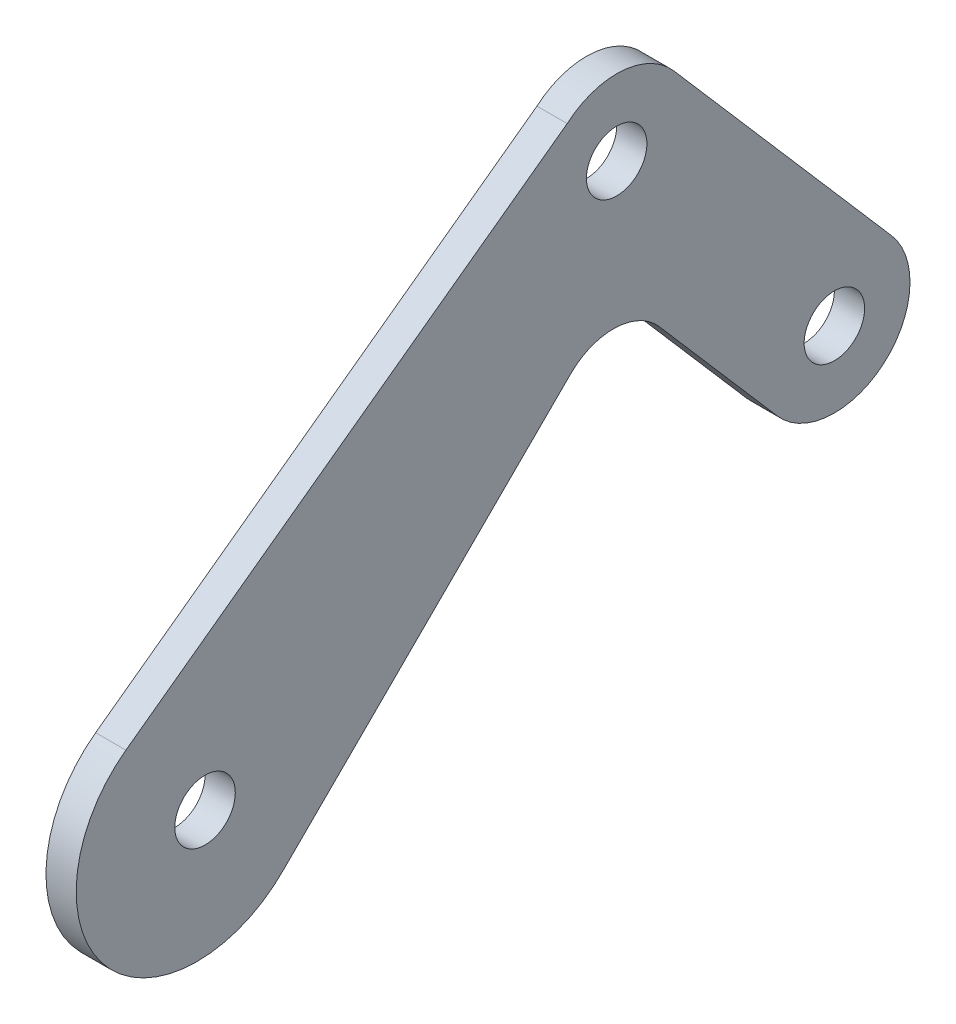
ISO-10303-21;
HEADER;
FILE_DESCRIPTION(('STEP AP214'),'2;1');
FILE_NAME('part.step','',(''),(''),'','','');
FILE_SCHEMA(('AUTOMOTIVE_DESIGN { 1 0 10303 214 1 1 1 1 }'));
ENDSEC;
DATA;
#1=APPLICATION_CONTEXT('core data for automotive mechanical design processes');
#2=APPLICATION_PROTOCOL_DEFINITION('international standard','automotive_design',2000,#1);
#3=PRODUCT_CONTEXT('',#1,'mechanical');
#4=PRODUCT('Part','Part','',(#3));
#5=PRODUCT_RELATED_PRODUCT_CATEGORY('part','',(#4));
#6=PRODUCT_DEFINITION_FORMATION('','',#4);
#7=PRODUCT_DEFINITION_CONTEXT('part definition',#1,'design');
#8=PRODUCT_DEFINITION('design','',#6,#7);
#9=PRODUCT_DEFINITION_SHAPE('','',#8);
#10=(LENGTH_UNIT() NAMED_UNIT(*) SI_UNIT(.MILLI.,.METRE.));
#11=(NAMED_UNIT(*) PLANE_ANGLE_UNIT() SI_UNIT($,.RADIAN.));
#12=(NAMED_UNIT(*) SI_UNIT($,.STERADIAN.) SOLID_ANGLE_UNIT());
#13=UNCERTAINTY_MEASURE_WITH_UNIT(LENGTH_MEASURE(1.E-05),#10,'distance_accuracy_value','');
#14=(GEOMETRIC_REPRESENTATION_CONTEXT(3) GLOBAL_UNCERTAINTY_ASSIGNED_CONTEXT((#13)) GLOBAL_UNIT_ASSIGNED_CONTEXT((#10,
#11,#12)) REPRESENTATION_CONTEXT('',''));
#15=CARTESIAN_POINT('',(0.,0.,0.));
#16=DIRECTION('',(0.,0.,1.));
#17=DIRECTION('',(1.,0.,0.));
#18=AXIS2_PLACEMENT_3D('',#15,#16,#17);
#19=CARTESIAN_POINT('',(1.5875000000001,-26.4076706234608,-22.8558648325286));
#20=DIRECTION('',(1.,0.,0.));
#21=DIRECTION('',(0.,0.,-1.));
#22=AXIS2_PLACEMENT_3D('',#19,#20,#21);
#23=PLANE('',#22);
#24=CARTESIAN_POINT('',(1.5875000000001,-26.4076706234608,-22.8558648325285));
#25=DIRECTION('',(1.,0.,0.));
#26=DIRECTION('',(0.,0.,-1.));
#27=AXIS2_PLACEMENT_3D('',#24,#25,#26);
#28=CIRCLE('',#27,3.17499999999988);
#29=CARTESIAN_POINT('',(1.5875000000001,-26.4076706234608,-26.0308648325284));
#30=VERTEX_POINT('',#29);
#31=EDGE_CURVE('E185',#30,#30,#28,.T.);
#32=ORIENTED_EDGE('',*,*,#31,.F.);
#33=EDGE_LOOP('',(#32));
#34=FACE_BOUND('',#33,.T.);
#35=CARTESIAN_POINT('',(1.5875000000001,-26.4076706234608,-22.8558648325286));
#36=DIRECTION('',(1.,0.,0.));
#37=DIRECTION('',(0.,0.,-1.));
#38=AXIS2_PLACEMENT_3D('',#35,#36,#37);
#39=CIRCLE('',#38,7.9374999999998);
#40=CARTESIAN_POINT('',(1.5875000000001,-31.6021853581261,-16.8541215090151));
#41=VERTEX_POINT('',#40);
#42=CARTESIAN_POINT('',(1.5875000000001,-21.2131558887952,-28.8576081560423));
#43=VERTEX_POINT('',#42);
#44=EDGE_CURVE('E148',#41,#43,#39,.T.);
#45=ORIENTED_EDGE('',*,*,#44,.T.);
#46=DIRECTION('',(0.,0.756125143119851,0.654427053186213));
#47=VECTOR('',#46,1.);
#48=CARTESIAN_POINT('',(1.5875000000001,-21.2131558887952,-28.8576081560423));
#49=LINE('',#48,#47);
#50=CARTESIAN_POINT('',(1.58749999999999,5.19451473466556,-6.0017433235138));
#51=VERTEX_POINT('',#50);
#52=EDGE_CURVE('E96',#43,#51,#49,.T.);
#53=ORIENTED_EDGE('',*,*,#52,.T.);
#54=CARTESIAN_POINT('',(1.58749999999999,0.,0.));
#55=DIRECTION('',(1.,0.,0.));
#56=DIRECTION('',(0.,0.,1.));
#57=AXIS2_PLACEMENT_3D('',#54,#55,#56);
#58=CIRCLE('',#57,7.9375);
#59=CARTESIAN_POINT('',(1.58749999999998,6.00174332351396,5.19451473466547));
#60=VERTEX_POINT('',#59);
#61=EDGE_CURVE('E163',#51,#60,#58,.T.);
#62=ORIENTED_EDGE('',*,*,#61,.T.);
#63=DIRECTION('',(0.,-0.589373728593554,0.807860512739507));
#64=VECTOR('',#63,1.);
#65=CARTESIAN_POINT('',(1.58749999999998,6.00174332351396,5.19451473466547));
#66=LINE('',#65,#64);
#67=CARTESIAN_POINT('',(1.5875000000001,-27.7977167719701,51.5237755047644));
#68=VERTEX_POINT('',#67);
#69=EDGE_CURVE('E176',#60,#68,#66,.T.);
#70=ORIENTED_EDGE('',*,*,#69,.T.);
#71=CARTESIAN_POINT('',(1.5875000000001,-38.0575452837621,44.0387291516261));
#72=DIRECTION('',(1.,0.,0.));
#73=DIRECTION('',(0.,0.,-1.));
#74=AXIS2_PLACEMENT_3D('',#71,#72,#73);
#75=CIRCLE('',#74,12.7000000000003);
#76=CARTESIAN_POINT('',(1.5875000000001,-46.9369546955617,34.9587463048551));
#77=VERTEX_POINT('',#76);
#78=EDGE_CURVE('E115',#68,#77,#75,.T.);
#79=ORIENTED_EDGE('',*,*,#78,.T.);
#80=DIRECTION('',(0.,0.705577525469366,-0.708632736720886));
#81=VECTOR('',#80,1.);
#82=CARTESIAN_POINT('',(1.5875000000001,-46.9369546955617,34.9587463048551));
#83=LINE('',#82,#81);
#84=CARTESIAN_POINT('',(1.58749999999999,-16.9335894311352,4.82546389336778));
#85=VERTEX_POINT('',#84);
#86=EDGE_CURVE('E109',#77,#85,#83,.T.);
#87=ORIENTED_EDGE('',*,*,#86,.T.);
#88=CARTESIAN_POINT('',(1.5875000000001,-21.4334073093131,0.34504660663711));
#89=DIRECTION('',(-1.,0.,0.));
#90=DIRECTION('',(0.,0.,-1.));
#91=AXIS2_PLACEMENT_3D('',#88,#89,#90);
#92=CIRCLE('',#91,6.35000000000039);
#93=CARTESIAN_POINT('',(1.5875000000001,-17.2777955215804,-4.45634805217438));
#94=VERTEX_POINT('',#93);
#95=EDGE_CURVE('E113',#85,#94,#92,.T.);
#96=ORIENTED_EDGE('',*,*,#95,.T.);
#97=DIRECTION('',(0.,-0.756125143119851,-0.654427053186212));
#98=VECTOR('',#97,1.);
#99=CARTESIAN_POINT('',(1.5875000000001,-31.6021853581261,-16.8541215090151));
#100=LINE('',#99,#98);
#101=EDGE_CURVE('E53',#94,#41,#100,.T.);
#102=ORIENTED_EDGE('',*,*,#101,.T.);
#103=EDGE_LOOP('',(#45,#53,#62,#70,#79,#87,#96,#102));
#104=FACE_BOUND('',#103,.T.);
#105=CARTESIAN_POINT('',(1.58749999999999,0.,0.));
#106=DIRECTION('',(1.,0.,0.));
#107=DIRECTION('',(0.,0.,-1.));
#108=AXIS2_PLACEMENT_3D('',#105,#106,#107);
#109=CIRCLE('',#108,3.175);
#110=CARTESIAN_POINT('',(1.58749999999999,0.,-3.17500000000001));
#111=VERTEX_POINT('',#110);
#112=EDGE_CURVE('E137',#111,#111,#109,.T.);
#113=ORIENTED_EDGE('',*,*,#112,.F.);
#114=EDGE_LOOP('',(#113));
#115=FACE_BOUND('',#114,.T.);
#116=CARTESIAN_POINT('',(1.5875000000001,-37.4005060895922,43.2125519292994));
#117=DIRECTION('',(1.,0.,0.));
#118=DIRECTION('',(0.,0.,-1.));
#119=AXIS2_PLACEMENT_3D('',#116,#117,#118);
#120=CIRCLE('',#119,3.17499999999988);
#121=CARTESIAN_POINT('',(1.5875000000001,-37.4005060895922,40.0375519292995));
#122=VERTEX_POINT('',#121);
#123=EDGE_CURVE('E191',#122,#122,#120,.T.);
#124=ORIENTED_EDGE('',*,*,#123,.F.);
#125=EDGE_LOOP('',(#124));
#126=FACE_BOUND('',#125,.T.);
#127=ADVANCED_FACE('F36',(#34,#104,#115,#126),#23,.T.);
#128=CARTESIAN_POINT('',(-1.58749999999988,-26.4076706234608,-22.8558648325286));
#129=DIRECTION('',(1.,0.,0.));
#130=DIRECTION('',(0.,0.,-1.));
#131=AXIS2_PLACEMENT_3D('',#128,#129,#130);
#132=PLANE('',#131);
#133=CARTESIAN_POINT('',(-1.58749999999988,-26.4076706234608,-22.8558648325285));
#134=DIRECTION('',(1.,0.,0.));
#135=DIRECTION('',(0.,0.,-1.));
#136=AXIS2_PLACEMENT_3D('',#133,#134,#135);
#137=CIRCLE('',#136,3.17499999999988);
#138=CARTESIAN_POINT('',(-1.58749999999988,-26.4076706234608,-26.0308648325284));
#139=VERTEX_POINT('',#138);
#140=EDGE_CURVE('E188',#139,#139,#137,.T.);
#141=ORIENTED_EDGE('',*,*,#140,.T.);
#142=EDGE_LOOP('',(#141));
#143=FACE_BOUND('',#142,.T.);
#144=CARTESIAN_POINT('',(-1.58749999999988,-26.4076706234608,-22.8558648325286));
#145=DIRECTION('',(1.,0.,0.));
#146=DIRECTION('',(0.,0.,-1.));
#147=AXIS2_PLACEMENT_3D('',#144,#145,#146);
#148=CIRCLE('',#147,7.9374999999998);
#149=CARTESIAN_POINT('',(-1.58749999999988,-31.6021853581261,-16.854121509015));
#150=VERTEX_POINT('',#149);
#151=CARTESIAN_POINT('',(-1.58749999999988,-21.2131558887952,-28.8576081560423));
#152=VERTEX_POINT('',#151);
#153=EDGE_CURVE('E133',#150,#152,#148,.T.);
#154=ORIENTED_EDGE('',*,*,#153,.F.);
#155=DIRECTION('',(0.,-0.756125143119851,-0.654427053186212));
#156=VECTOR('',#155,1.);
#157=CARTESIAN_POINT('',(-1.58749999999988,-31.6021853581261,-16.854121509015));
#158=LINE('',#157,#156);
#159=CARTESIAN_POINT('',(-1.58749999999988,-17.2777955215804,-4.45634805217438));
#160=VERTEX_POINT('',#159);
#161=EDGE_CURVE('E88',#160,#150,#158,.T.);
#162=ORIENTED_EDGE('',*,*,#161,.F.);
#163=CARTESIAN_POINT('',(-1.58749999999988,-21.4334073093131,0.34504660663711));
#164=DIRECTION('',(-1.,0.,0.));
#165=DIRECTION('',(0.,0.,-1.));
#166=AXIS2_PLACEMENT_3D('',#163,#164,#165);
#167=CIRCLE('',#166,6.35000000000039);
#168=CARTESIAN_POINT('',(-1.58749999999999,-16.9335894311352,4.82546389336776));
#169=VERTEX_POINT('',#168);
#170=EDGE_CURVE('E82',#169,#160,#167,.T.);
#171=ORIENTED_EDGE('',*,*,#170,.F.);
#172=DIRECTION('',(0.,0.705577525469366,-0.708632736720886));
#173=VECTOR('',#172,1.);
#174=CARTESIAN_POINT('',(-1.58749999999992,-46.9369546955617,34.9587463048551));
#175=LINE('',#174,#173);
#176=CARTESIAN_POINT('',(-1.58749999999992,-46.9369546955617,34.9587463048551));
#177=VERTEX_POINT('',#176);
#178=EDGE_CURVE('E123',#177,#169,#175,.T.);
#179=ORIENTED_EDGE('',*,*,#178,.F.);
#180=CARTESIAN_POINT('',(-1.58749999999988,-38.0575452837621,44.0387291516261));
#181=DIRECTION('',(1.,0.,0.));
#182=DIRECTION('',(0.,0.,-1.));
#183=AXIS2_PLACEMENT_3D('',#180,#181,#182);
#184=CIRCLE('',#183,12.7000000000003);
#185=CARTESIAN_POINT('',(-1.58749999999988,-27.7977167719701,51.5237755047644));
#186=VERTEX_POINT('',#185);
#187=EDGE_CURVE('E143',#186,#177,#184,.T.);
#188=ORIENTED_EDGE('',*,*,#187,.F.);
#189=DIRECTION('',(0.,-0.589373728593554,0.807860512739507));
#190=VECTOR('',#189,1.);
#191=CARTESIAN_POINT('',(-1.5875,6.00174332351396,5.19451473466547));
#192=LINE('',#191,#190);
#193=CARTESIAN_POINT('',(-1.5875,6.00174332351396,5.19451473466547));
#194=VERTEX_POINT('',#193);
#195=EDGE_CURVE('E141',#194,#186,#192,.T.);
#196=ORIENTED_EDGE('',*,*,#195,.F.);
#197=CARTESIAN_POINT('',(-1.58749999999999,0.,0.));
#198=DIRECTION('',(1.,0.,0.));
#199=DIRECTION('',(0.,0.,1.));
#200=AXIS2_PLACEMENT_3D('',#197,#198,#199);
#201=CIRCLE('',#200,7.9375);
#202=CARTESIAN_POINT('',(-1.58749999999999,5.19451473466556,-6.0017433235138));
#203=VERTEX_POINT('',#202);
#204=EDGE_CURVE('E139',#203,#194,#201,.T.);
#205=ORIENTED_EDGE('',*,*,#204,.F.);
#206=DIRECTION('',(0.,0.756125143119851,0.654427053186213));
#207=VECTOR('',#206,1.);
#208=CARTESIAN_POINT('',(-1.58749999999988,-21.2131558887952,-28.8576081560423));
#209=LINE('',#208,#207);
#210=EDGE_CURVE('E136',#152,#203,#209,.T.);
#211=ORIENTED_EDGE('',*,*,#210,.F.);
#212=EDGE_LOOP('',(#154,#162,#171,#179,#188,#196,#205,#211));
#213=FACE_BOUND('',#212,.T.);
#214=CARTESIAN_POINT('',(-1.58749999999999,0.,0.));
#215=DIRECTION('',(1.,0.,0.));
#216=DIRECTION('',(0.,0.,-1.));
#217=AXIS2_PLACEMENT_3D('',#214,#215,#216);
#218=CIRCLE('',#217,3.175);
#219=CARTESIAN_POINT('',(-1.58749999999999,0.,-3.17500000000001));
#220=VERTEX_POINT('',#219);
#221=EDGE_CURVE('E182',#220,#220,#218,.T.);
#222=ORIENTED_EDGE('',*,*,#221,.T.);
#223=EDGE_LOOP('',(#222));
#224=FACE_BOUND('',#223,.T.);
#225=CARTESIAN_POINT('',(-1.58749999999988,-37.4005060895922,43.2125519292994));
#226=DIRECTION('',(1.,0.,0.));
#227=DIRECTION('',(0.,0.,-1.));
#228=AXIS2_PLACEMENT_3D('',#225,#226,#227);
#229=CIRCLE('',#228,3.17499999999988);
#230=CARTESIAN_POINT('',(-1.58749999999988,-37.4005060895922,40.0375519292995));
#231=VERTEX_POINT('',#230);
#232=EDGE_CURVE('E194',#231,#231,#229,.T.);
#233=ORIENTED_EDGE('',*,*,#232,.T.);
#234=EDGE_LOOP('',(#233));
#235=FACE_BOUND('',#234,.T.);
#236=ADVANCED_FACE('F167',(#143,#213,#224,#235),#132,.F.);
#237=CARTESIAN_POINT('',(1.5875000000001,-26.4076706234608,-22.8558648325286));
#238=DIRECTION('',(-1.,0.,0.));
#239=DIRECTION('',(0.,0.,1.));
#240=AXIS2_PLACEMENT_3D('',#237,#238,#239);
#241=CYLINDRICAL_SURFACE('',#240,7.9374999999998);
#242=ORIENTED_EDGE('',*,*,#153,.T.);
#243=DIRECTION('',(-1.,0.,0.));
#244=VECTOR('',#243,1.);
#245=CARTESIAN_POINT('',(1.5875000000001,-21.2131558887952,-28.8576081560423));
#246=LINE('',#245,#244);
#247=EDGE_CURVE('E11',#43,#152,#246,.T.);
#248=ORIENTED_EDGE('',*,*,#247,.F.);
#249=ORIENTED_EDGE('',*,*,#44,.F.);
#250=DIRECTION('',(-1.,0.,0.));
#251=VECTOR('',#250,1.);
#252=CARTESIAN_POINT('',(1.5875000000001,-31.6021853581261,-16.8541215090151));
#253=LINE('',#252,#251);
#254=EDGE_CURVE('E129',#41,#150,#253,.T.);
#255=ORIENTED_EDGE('',*,*,#254,.T.);
#256=EDGE_LOOP('',(#242,#248,#249,#255));
#257=FACE_BOUND('',#256,.T.);
#258=ADVANCED_FACE('F38',(#257),#241,.T.);
#259=CARTESIAN_POINT('',(1.5875000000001,-21.2131558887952,-28.8576081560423));
#260=DIRECTION('',(0.,-0.654427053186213,0.756125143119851));
#261=DIRECTION('',(0.,-0.756125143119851,-0.654427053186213));
#262=AXIS2_PLACEMENT_3D('',#259,#260,#261);
#263=PLANE('',#262);
#264=ORIENTED_EDGE('',*,*,#210,.T.);
#265=DIRECTION('',(-1.,0.,0.));
#266=VECTOR('',#265,1.);
#267=CARTESIAN_POINT('',(1.58749999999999,5.19451473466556,-6.0017433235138));
#268=LINE('',#267,#266);
#269=EDGE_CURVE('E45',#51,#203,#268,.T.);
#270=ORIENTED_EDGE('',*,*,#269,.F.);
#271=ORIENTED_EDGE('',*,*,#52,.F.);
#272=ORIENTED_EDGE('',*,*,#247,.T.);
#273=EDGE_LOOP('',(#264,#270,#271,#272));
#274=FACE_BOUND('',#273,.T.);
#275=ADVANCED_FACE('F228',(#274),#263,.F.);
#276=CARTESIAN_POINT('',(1.58749999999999,0.,0.));
#277=DIRECTION('',(-1.,0.,0.));
#278=DIRECTION('',(0.,0.,1.));
#279=AXIS2_PLACEMENT_3D('',#276,#277,#278);
#280=CYLINDRICAL_SURFACE('',#279,7.9375);
#281=ORIENTED_EDGE('',*,*,#204,.T.);
#282=DIRECTION('',(-1.,0.,0.));
#283=VECTOR('',#282,1.);
#284=CARTESIAN_POINT('',(1.58749999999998,6.00174332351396,5.19451473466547));
#285=LINE('',#284,#283);
#286=EDGE_CURVE('E155',#60,#194,#285,.T.);
#287=ORIENTED_EDGE('',*,*,#286,.F.);
#288=ORIENTED_EDGE('',*,*,#61,.F.);
#289=ORIENTED_EDGE('',*,*,#269,.T.);
#290=EDGE_LOOP('',(#281,#287,#288,#289));
#291=FACE_BOUND('',#290,.T.);
#292=ADVANCED_FACE('F161',(#291),#280,.T.);
#293=CARTESIAN_POINT('',(1.58749999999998,6.00174332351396,5.19451473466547));
#294=DIRECTION('',(0.,-0.807860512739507,-0.589373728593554));
#295=DIRECTION('',(0.,0.589373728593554,-0.807860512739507));
#296=AXIS2_PLACEMENT_3D('',#293,#294,#295);
#297=PLANE('',#296);
#298=ORIENTED_EDGE('',*,*,#195,.T.);
#299=DIRECTION('',(-1.,0.,0.));
#300=VECTOR('',#299,1.);
#301=CARTESIAN_POINT('',(1.5875000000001,-27.7977167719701,51.5237755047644));
#302=LINE('',#301,#300);
#303=EDGE_CURVE('E152',#68,#186,#302,.T.);
#304=ORIENTED_EDGE('',*,*,#303,.F.);
#305=ORIENTED_EDGE('',*,*,#69,.F.);
#306=ORIENTED_EDGE('',*,*,#286,.T.);
#307=EDGE_LOOP('',(#298,#304,#305,#306));
#308=FACE_BOUND('',#307,.T.);
#309=ADVANCED_FACE('F172',(#308),#297,.F.);
#310=CARTESIAN_POINT('',(1.5875000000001,-38.0575452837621,44.0387291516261));
#311=DIRECTION('',(-1.,0.,0.));
#312=DIRECTION('',(0.,0.,1.));
#313=AXIS2_PLACEMENT_3D('',#310,#311,#312);
#314=CYLINDRICAL_SURFACE('',#313,12.7000000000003);
#315=ORIENTED_EDGE('',*,*,#187,.T.);
#316=DIRECTION('',(-1.,0.,0.));
#317=VECTOR('',#316,1.);
#318=CARTESIAN_POINT('',(1.5875000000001,-46.9369546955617,34.9587463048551));
#319=LINE('',#318,#317);
#320=EDGE_CURVE('E124',#77,#177,#319,.T.);
#321=ORIENTED_EDGE('',*,*,#320,.F.);
#322=ORIENTED_EDGE('',*,*,#78,.F.);
#323=ORIENTED_EDGE('',*,*,#303,.T.);
#324=EDGE_LOOP('',(#315,#321,#322,#323));
#325=FACE_BOUND('',#324,.T.);
#326=ADVANCED_FACE('F175',(#325),#314,.T.);
#327=CARTESIAN_POINT('',(1.5875000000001,-46.9369546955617,34.9587463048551));
#328=DIRECTION('',(0.,0.708632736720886,0.705577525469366));
#329=DIRECTION('',(0.,-0.705577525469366,0.708632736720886));
#330=AXIS2_PLACEMENT_3D('',#327,#328,#329);
#331=PLANE('',#330);
#332=ORIENTED_EDGE('',*,*,#178,.T.);
#333=DIRECTION('',(-1.,0.,0.));
#334=VECTOR('',#333,1.);
#335=CARTESIAN_POINT('',(1.58749999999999,-16.9335894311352,4.82546389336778));
#336=LINE('',#335,#334);
#337=EDGE_CURVE('E120',#85,#169,#336,.T.);
#338=ORIENTED_EDGE('',*,*,#337,.F.);
#339=ORIENTED_EDGE('',*,*,#86,.F.);
#340=ORIENTED_EDGE('',*,*,#320,.T.);
#341=EDGE_LOOP('',(#332,#338,#339,#340));
#342=FACE_BOUND('',#341,.T.);
#343=ADVANCED_FACE('F121',(#342),#331,.F.);
#344=CARTESIAN_POINT('',(1.5875000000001,-21.4334073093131,0.34504660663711));
#345=DIRECTION('',(-1.,0.,0.));
#346=DIRECTION('',(0.,0.,1.));
#347=AXIS2_PLACEMENT_3D('',#344,#345,#346);
#348=CYLINDRICAL_SURFACE('',#347,6.35000000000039);
#349=ORIENTED_EDGE('',*,*,#170,.T.);
#350=DIRECTION('',(-1.,0.,0.));
#351=VECTOR('',#350,1.);
#352=CARTESIAN_POINT('',(1.5875000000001,-17.2777955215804,-4.45634805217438));
#353=LINE('',#352,#351);
#354=EDGE_CURVE('E125',#94,#160,#353,.T.);
#355=ORIENTED_EDGE('',*,*,#354,.F.);
#356=ORIENTED_EDGE('',*,*,#95,.F.);
#357=ORIENTED_EDGE('',*,*,#337,.T.);
#358=EDGE_LOOP('',(#349,#355,#356,#357));
#359=FACE_BOUND('',#358,.T.);
#360=ADVANCED_FACE('F127',(#359),#348,.F.);
#361=CARTESIAN_POINT('',(1.5875000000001,-31.6021853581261,-16.8541215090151));
#362=DIRECTION('',(0.,0.654427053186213,-0.756125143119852));
#363=DIRECTION('',(0.,0.756125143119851,0.654427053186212));
#364=AXIS2_PLACEMENT_3D('',#361,#362,#363);
#365=PLANE('',#364);
#366=ORIENTED_EDGE('',*,*,#161,.T.);
#367=ORIENTED_EDGE('',*,*,#254,.F.);
#368=ORIENTED_EDGE('',*,*,#101,.F.);
#369=ORIENTED_EDGE('',*,*,#354,.T.);
#370=EDGE_LOOP('',(#366,#367,#368,#369));
#371=FACE_BOUND('',#370,.T.);
#372=ADVANCED_FACE('F216',(#371),#365,.F.);
#373=CARTESIAN_POINT('',(1.58749999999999,0.,0.));
#374=DIRECTION('',(-1.,0.,0.));
#375=DIRECTION('',(0.,0.,1.));
#376=AXIS2_PLACEMENT_3D('',#373,#374,#375);
#377=CYLINDRICAL_SURFACE('',#376,3.175);
#378=ORIENTED_EDGE('',*,*,#112,.T.);
#379=EDGE_LOOP('',(#378));
#380=FACE_BOUND('',#379,.T.);
#381=ORIENTED_EDGE('',*,*,#221,.F.);
#382=EDGE_LOOP('',(#381));
#383=FACE_BOUND('',#382,.T.);
#384=ADVANCED_FACE('F213',(#380,#383),#377,.F.);
#385=CARTESIAN_POINT('',(1.5875000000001,-26.4076706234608,-22.8558648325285));
#386=DIRECTION('',(-1.,0.,0.));
#387=DIRECTION('',(0.,0.,1.));
#388=AXIS2_PLACEMENT_3D('',#385,#386,#387);
#389=CYLINDRICAL_SURFACE('',#388,3.17499999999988);
#390=ORIENTED_EDGE('',*,*,#31,.T.);
#391=EDGE_LOOP('',(#390));
#392=FACE_BOUND('',#391,.T.);
#393=ORIENTED_EDGE('',*,*,#140,.F.);
#394=EDGE_LOOP('',(#393));
#395=FACE_BOUND('',#394,.T.);
#396=ADVANCED_FACE('F292',(#392,#395),#389,.F.);
#397=CARTESIAN_POINT('',(1.5875000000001,-37.4005060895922,43.2125519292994));
#398=DIRECTION('',(-1.,0.,0.));
#399=DIRECTION('',(0.,0.,1.));
#400=AXIS2_PLACEMENT_3D('',#397,#398,#399);
#401=CYLINDRICAL_SURFACE('',#400,3.17499999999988);
#402=ORIENTED_EDGE('',*,*,#123,.T.);
#403=EDGE_LOOP('',(#402));
#404=FACE_BOUND('',#403,.T.);
#405=ORIENTED_EDGE('',*,*,#232,.F.);
#406=EDGE_LOOP('',(#405));
#407=FACE_BOUND('',#406,.T.);
#408=ADVANCED_FACE('F200',(#404,#407),#401,.F.);
#409=CLOSED_SHELL('',(#127,#236,#258,#275,#292,#309,#326,#343,#360,#372,#384,#396,#408));
#410=MANIFOLD_SOLID_BREP('B2',#409);
#411=ADVANCED_BREP_SHAPE_REPRESENTATION('',(#18,#410),#14);
#412=SHAPE_DEFINITION_REPRESENTATION(#9,#411);
ENDSEC;
END-ISO-10303-21;
